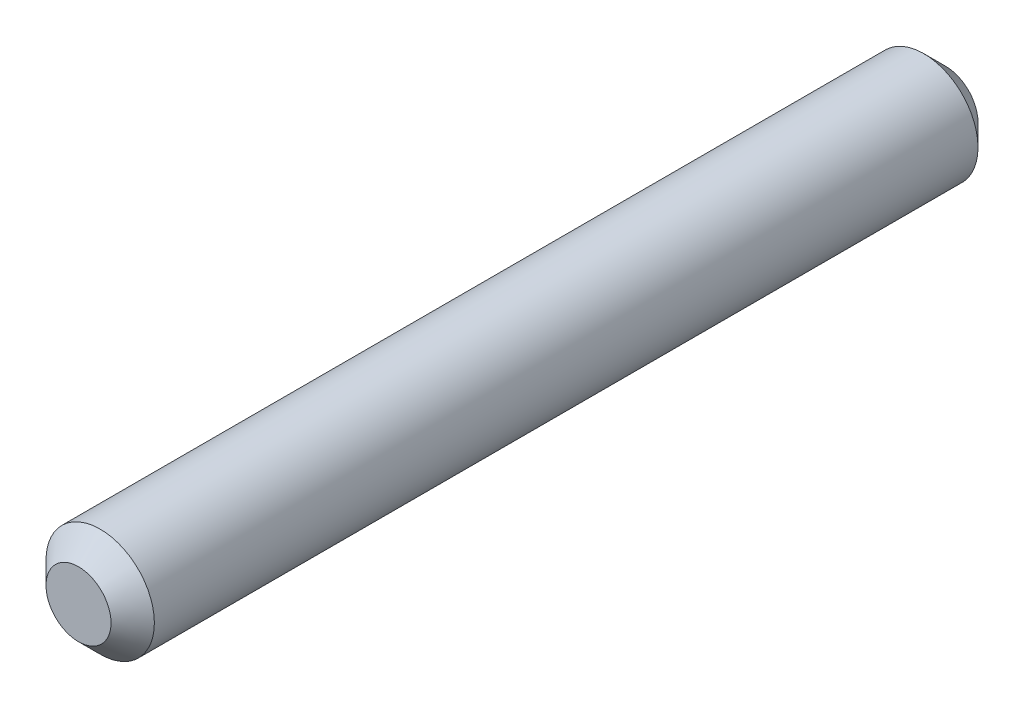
ISO-10303-21;
HEADER;
FILE_DESCRIPTION(('STEP AP214'),'2;1');
FILE_NAME('part.step','',(''),(''),'','','');
FILE_SCHEMA(('AUTOMOTIVE_DESIGN { 1 0 10303 214 1 1 1 1 }'));
ENDSEC;
DATA;
#1=APPLICATION_CONTEXT('core data for automotive mechanical design processes');
#2=APPLICATION_PROTOCOL_DEFINITION('international standard','automotive_design',2000,#1);
#3=PRODUCT_CONTEXT('',#1,'mechanical');
#4=PRODUCT('Part','Part','',(#3));
#5=PRODUCT_RELATED_PRODUCT_CATEGORY('part','',(#4));
#6=PRODUCT_DEFINITION_FORMATION('','',#4);
#7=PRODUCT_DEFINITION_CONTEXT('part definition',#1,'design');
#8=PRODUCT_DEFINITION('design','',#6,#7);
#9=PRODUCT_DEFINITION_SHAPE('','',#8);
#10=(LENGTH_UNIT() NAMED_UNIT(*) SI_UNIT(.MILLI.,.METRE.));
#11=(NAMED_UNIT(*) PLANE_ANGLE_UNIT() SI_UNIT($,.RADIAN.));
#12=(NAMED_UNIT(*) SI_UNIT($,.STERADIAN.) SOLID_ANGLE_UNIT());
#13=UNCERTAINTY_MEASURE_WITH_UNIT(LENGTH_MEASURE(1.E-05),#10,'distance_accuracy_value','');
#14=(GEOMETRIC_REPRESENTATION_CONTEXT(3) GLOBAL_UNCERTAINTY_ASSIGNED_CONTEXT((#13)) GLOBAL_UNIT_ASSIGNED_CONTEXT((#10,
#11,#12)) REPRESENTATION_CONTEXT('',''));
#15=CARTESIAN_POINT('',(0.,0.,0.));
#16=DIRECTION('',(0.,0.,1.));
#17=DIRECTION('',(1.,0.,0.));
#18=AXIS2_PLACEMENT_3D('',#15,#16,#17);
#19=CARTESIAN_POINT('',(0.,0.,25.4));
#20=DIRECTION('',(0.,0.,-1.));
#21=DIRECTION('',(-1.,0.,0.));
#22=AXIS2_PLACEMENT_3D('',#19,#20,#21);
#23=CYLINDRICAL_SURFACE('',#22,1.5875);
#24=CARTESIAN_POINT('',(0.,0.,0.635000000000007));
#25=DIRECTION('',(0.,0.,1.));
#26=DIRECTION('',(1.,0.,0.));
#27=AXIS2_PLACEMENT_3D('',#24,#25,#26);
#28=CIRCLE('',#27,1.5875);
#29=CARTESIAN_POINT('',(1.5875,0.,0.635000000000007));
#30=VERTEX_POINT('',#29);
#31=EDGE_CURVE('E58',#30,#30,#28,.T.);
#32=ORIENTED_EDGE('',*,*,#31,.T.);
#33=EDGE_LOOP('',(#32));
#34=FACE_BOUND('',#33,.T.);
#35=CARTESIAN_POINT('',(0.,0.,24.765));
#36=DIRECTION('',(0.,0.,1.));
#37=DIRECTION('',(1.,0.,0.));
#38=AXIS2_PLACEMENT_3D('',#35,#36,#37);
#39=CIRCLE('',#38,1.5875);
#40=CARTESIAN_POINT('',(1.5875,0.,24.765));
#41=VERTEX_POINT('',#40);
#42=EDGE_CURVE('E63',#41,#41,#39,.F.);
#43=ORIENTED_EDGE('',*,*,#42,.T.);
#44=EDGE_LOOP('',(#43));
#45=FACE_BOUND('',#44,.T.);
#46=ADVANCED_FACE('F44',(#34,#45),#23,.T.);
#47=CARTESIAN_POINT('',(0.,0.,25.4));
#48=DIRECTION('',(0.,0.,1.));
#49=DIRECTION('',(1.,0.,0.));
#50=AXIS2_PLACEMENT_3D('',#47,#48,#49);
#51=PLANE('',#50);
#52=CARTESIAN_POINT('',(0.,0.,25.4));
#53=DIRECTION('',(0.,0.,1.));
#54=DIRECTION('',(1.,0.,0.));
#55=AXIS2_PLACEMENT_3D('',#52,#53,#54);
#56=CIRCLE('',#55,0.952499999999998);
#57=CARTESIAN_POINT('',(0.952499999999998,0.,25.4));
#58=VERTEX_POINT('',#57);
#59=EDGE_CURVE('E10',#58,#58,#56,.T.);
#60=ORIENTED_EDGE('',*,*,#59,.T.);
#61=EDGE_LOOP('',(#60));
#62=FACE_BOUND('',#61,.T.);
#63=ADVANCED_FACE('F80',(#62),#51,.T.);
#64=CARTESIAN_POINT('',(0.,0.,0.));
#65=DIRECTION('',(0.,0.,1.));
#66=DIRECTION('',(1.,0.,0.));
#67=AXIS2_PLACEMENT_3D('',#64,#65,#66);
#68=PLANE('',#67);
#69=CARTESIAN_POINT('',(0.,0.,0.));
#70=DIRECTION('',(0.,0.,1.));
#71=DIRECTION('',(1.,0.,0.));
#72=AXIS2_PLACEMENT_3D('',#69,#70,#71);
#73=CIRCLE('',#72,0.952499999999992);
#74=CARTESIAN_POINT('',(0.952499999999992,0.,0.));
#75=VERTEX_POINT('',#74);
#76=EDGE_CURVE('E53',#75,#75,#73,.F.);
#77=ORIENTED_EDGE('',*,*,#76,.T.);
#78=EDGE_LOOP('',(#77));
#79=FACE_BOUND('',#78,.T.);
#80=ADVANCED_FACE('F77',(#79),#68,.F.);
#81=CARTESIAN_POINT('',(0.,0.,0.635000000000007));
#82=DIRECTION('',(0.,0.,1.));
#83=DIRECTION('',(1.,0.,0.));
#84=AXIS2_PLACEMENT_3D('',#81,#82,#83);
#85=CONICAL_SURFACE('',#84,1.5875,0.785398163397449);
#86=ORIENTED_EDGE('',*,*,#76,.F.);
#87=EDGE_LOOP('',(#86));
#88=FACE_BOUND('',#87,.T.);
#89=ORIENTED_EDGE('',*,*,#31,.F.);
#90=EDGE_LOOP('',(#89));
#91=FACE_BOUND('',#90,.T.);
#92=ADVANCED_FACE('F73',(#88,#91),#85,.T.);
#93=CARTESIAN_POINT('',(0.,0.,25.4));
#94=DIRECTION('',(0.,0.,-1.));
#95=DIRECTION('',(-1.,0.,0.));
#96=AXIS2_PLACEMENT_3D('',#93,#94,#95);
#97=CONICAL_SURFACE('',#96,0.952499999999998,0.785398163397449);
#98=ORIENTED_EDGE('',*,*,#42,.F.);
#99=EDGE_LOOP('',(#98));
#100=FACE_BOUND('',#99,.T.);
#101=ORIENTED_EDGE('',*,*,#59,.F.);
#102=EDGE_LOOP('',(#101));
#103=FACE_BOUND('',#102,.T.);
#104=ADVANCED_FACE('F47',(#100,#103),#97,.T.);
#105=CLOSED_SHELL('',(#46,#63,#80,#92,#104));
#106=MANIFOLD_SOLID_BREP('B2',#105);
#107=ADVANCED_BREP_SHAPE_REPRESENTATION('',(#18,#106),#14);
#108=SHAPE_DEFINITION_REPRESENTATION(#9,#107);
ENDSEC;
END-ISO-10303-21;
